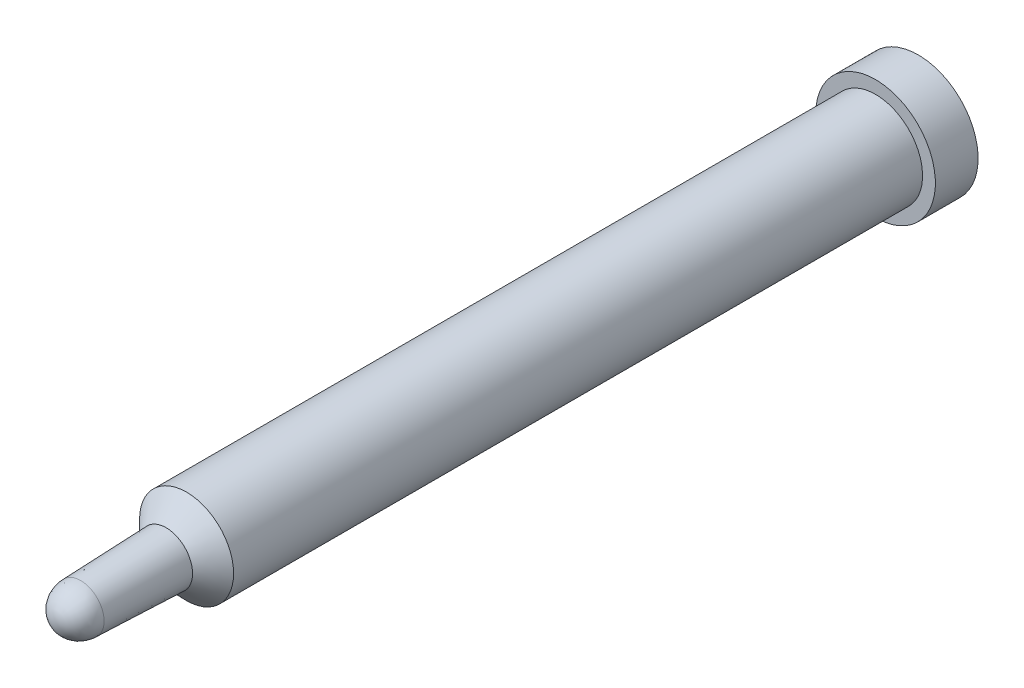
from build123d import *

# Parameters (mm, degrees)
ESQUISSE1_R          = 5.5
BASE_EXTRUSION_DEPTH = 88
CHANFREIN1_SIZE      = 2.4
ESQUISSE2_R          = 3.1
BOSS_EXTRU_1_DEPTH   = 10
BOSS_EXTRU_1_TAPER   = 2
D_ME1_FACE_RADIUS    = 2.750792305
D_ME1_HEIGHT         = 3
ESQUISSE3_R          = 7
BOSS_EXTRU_2_DEPTH   = 5


with BuildPart() as part:
    # Esquisse1 → Base-Extrusion (new body)
    with BuildSketch(Plane.XY):
        Circle(ESQUISSE1_R)
    extrude(amount=BASE_EXTRUSION_DEPTH)

    # Chanfrein1
    chanfrein1_edges = [part.edges().sort_by_distance(p)[0] for p in [
        (-5.5, 0, 88),
    ]]
    chamfer(chanfrein1_edges, length=CHANFREIN1_SIZE)

    # Esquisse2 → Boss.-Extru.1 (add)
    with BuildSketch(Plane.XY.offset(88)):
        Circle(ESQUISSE2_R)
    extrude(amount=BOSS_EXTRU_1_DEPTH, taper=BOSS_EXTRU_1_TAPER)

    # D_me1: an elliptical dome of height H over a round flat face of radius A is half a spheroid: the quarter ellipse of half axes A and H revolved about the face's axis
    with BuildSketch(Plane((0, 0, 98), x_dir=(0, 1, 0), z_dir=(1, 0, 0)), mode=Mode.PRIVATE) as d_me1_quarter:
        Ellipse(D_ME1_FACE_RADIUS, D_ME1_HEIGHT)
        Rectangle(D_ME1_FACE_RADIUS, D_ME1_HEIGHT, align=(Align.MIN, Align.MIN), mode=Mode.INTERSECT)
    revolve(d_me1_quarter.sketch, axis=Axis((0, 0, 98), (0, 0, 1)))

    # Esquisse3 → Boss.-Extru.2 (add)
    with BuildSketch(Plane(origin=(0, 0, 0), x_dir=(-1, 0, 0), z_dir=(0, 0, -1))):
        Circle(ESQUISSE3_R)
    extrude(amount=-BOSS_EXTRU_2_DEPTH)


solid = part.part
